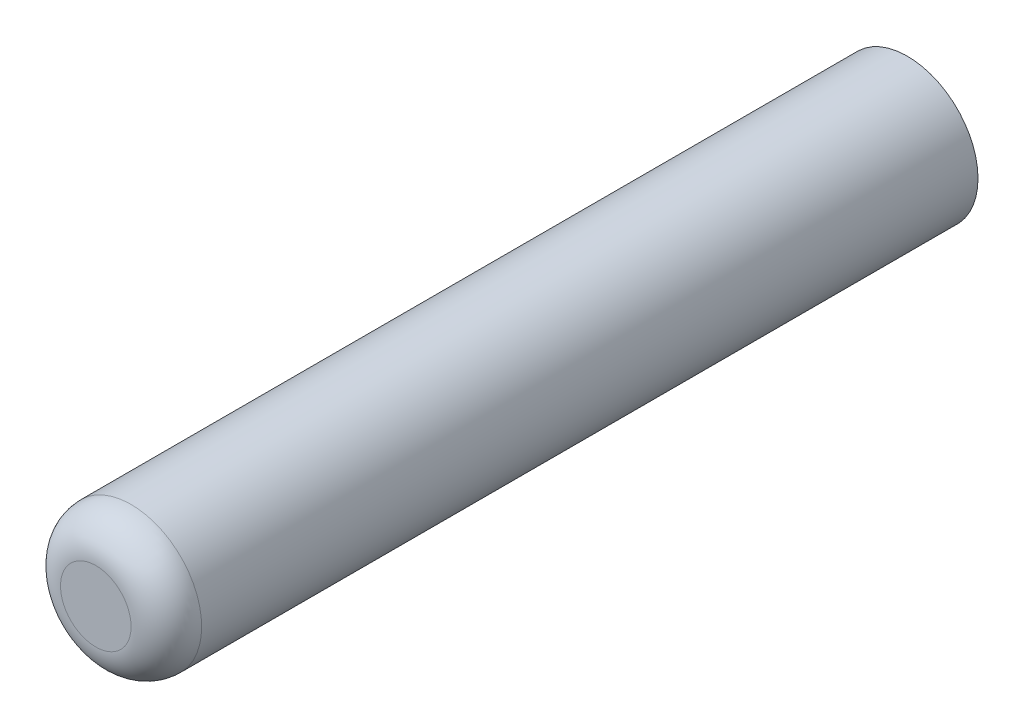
from build123d import *

# Parameters (mm, degrees)
ESQUISSE1_R = 1
AXE_DEPTH   = 5.75
CONG_R      = 0.5


with BuildPart() as part:
    # Esquisse1 → Axe (new, symmetric)
    with BuildSketch(Plane.XY):
        Circle(ESQUISSE1_R)
    extrude(amount=AXE_DEPTH, both=True)

    # Cong
    cong_edges = [part.edges().sort_by_distance(p)[0] for p in [
        (-1, 0, 5.75),
    ]]
    fillet(cong_edges, radius=CONG_R)


solid = part.part
